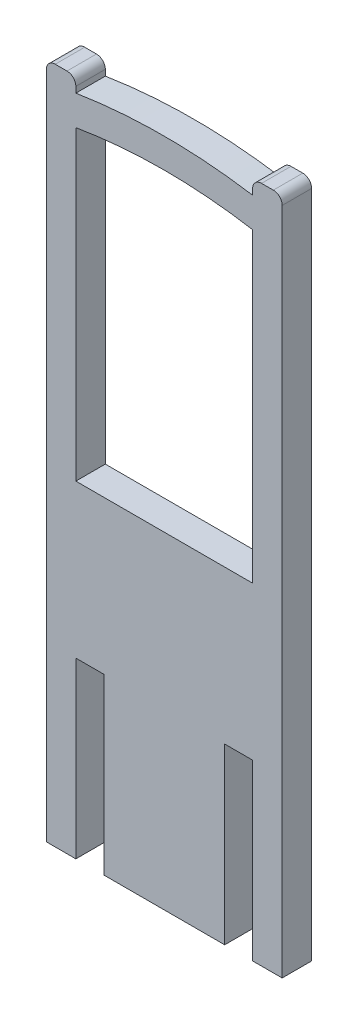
ISO-10303-21;
HEADER;
FILE_DESCRIPTION(('STEP AP214'),'2;1');
FILE_NAME('part.step','',(''),(''),'','','');
FILE_SCHEMA(('AUTOMOTIVE_DESIGN { 1 0 10303 214 1 1 1 1 }'));
ENDSEC;
DATA;
#1=APPLICATION_CONTEXT('core data for automotive mechanical design processes');
#2=APPLICATION_PROTOCOL_DEFINITION('international standard','automotive_design',2000,#1);
#3=PRODUCT_CONTEXT('',#1,'mechanical');
#4=PRODUCT('Part','Part','',(#3));
#5=PRODUCT_RELATED_PRODUCT_CATEGORY('part','',(#4));
#6=PRODUCT_DEFINITION_FORMATION('','',#4);
#7=PRODUCT_DEFINITION_CONTEXT('part definition',#1,'design');
#8=PRODUCT_DEFINITION('design','',#6,#7);
#9=PRODUCT_DEFINITION_SHAPE('','',#8);
#10=(LENGTH_UNIT() NAMED_UNIT(*) SI_UNIT(.MILLI.,.METRE.));
#11=(NAMED_UNIT(*) PLANE_ANGLE_UNIT() SI_UNIT($,.RADIAN.));
#12=(NAMED_UNIT(*) SI_UNIT($,.STERADIAN.) SOLID_ANGLE_UNIT());
#13=UNCERTAINTY_MEASURE_WITH_UNIT(LENGTH_MEASURE(1.E-05),#10,'distance_accuracy_value','');
#14=(GEOMETRIC_REPRESENTATION_CONTEXT(3) GLOBAL_UNCERTAINTY_ASSIGNED_CONTEXT((#13)) GLOBAL_UNIT_ASSIGNED_CONTEXT((#10,
#11,#12)) REPRESENTATION_CONTEXT('',''));
#15=CARTESIAN_POINT('',(0.,0.,0.));
#16=DIRECTION('',(0.,0.,1.));
#17=DIRECTION('',(1.,0.,0.));
#18=AXIS2_PLACEMENT_3D('',#15,#16,#17);
#19=CARTESIAN_POINT('',(37.0000000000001,236.,10.));
#20=DIRECTION('',(0.,0.,1.));
#21=DIRECTION('',(1.,0.,0.));
#22=AXIS2_PLACEMENT_3D('',#19,#20,#21);
#23=PLANE('',#22);
#24=DIRECTION('',(0.,1.,0.));
#25=VECTOR('',#24,1.);
#26=CARTESIAN_POINT('',(-30.,9.,10.));
#27=LINE('',#26,#25);
#28=CARTESIAN_POINT('',(-30.,9.,10.));
#29=VERTEX_POINT('',#28);
#30=CARTESIAN_POINT('',(-30.,68.,10.));
#31=VERTEX_POINT('',#30);
#32=EDGE_CURVE('E230',#29,#31,#27,.T.);
#33=ORIENTED_EDGE('',*,*,#32,.T.);
#34=DIRECTION('',(1.,0.,0.));
#35=VECTOR('',#34,1.);
#36=CARTESIAN_POINT('',(-30.,68.,10.));
#37=LINE('',#36,#35);
#38=CARTESIAN_POINT('',(-20.5000000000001,68.,10.));
#39=VERTEX_POINT('',#38);
#40=EDGE_CURVE('E233',#31,#39,#37,.T.);
#41=ORIENTED_EDGE('',*,*,#40,.T.);
#42=DIRECTION('',(0.,-1.,0.));
#43=VECTOR('',#42,1.);
#44=CARTESIAN_POINT('',(-20.5000000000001,68.,10.));
#45=LINE('',#44,#43);
#46=CARTESIAN_POINT('',(-20.5000000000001,8.99999999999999,10.));
#47=VERTEX_POINT('',#46);
#48=EDGE_CURVE('E236',#39,#47,#45,.T.);
#49=ORIENTED_EDGE('',*,*,#48,.T.);
#50=DIRECTION('',(1.,0.,0.));
#51=VECTOR('',#50,1.);
#52=CARTESIAN_POINT('',(20.5000000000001,8.99999999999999,10.));
#53=LINE('',#52,#51);
#54=CARTESIAN_POINT('',(20.5000000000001,8.99999999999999,10.));
#55=VERTEX_POINT('',#54);
#56=EDGE_CURVE('E238',#47,#55,#53,.T.);
#57=ORIENTED_EDGE('',*,*,#56,.T.);
#58=DIRECTION('',(0.,1.,0.));
#59=VECTOR('',#58,1.);
#60=CARTESIAN_POINT('',(20.5000000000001,68.,10.));
#61=LINE('',#60,#59);
#62=CARTESIAN_POINT('',(20.5000000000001,68.,10.));
#63=VERTEX_POINT('',#62);
#64=EDGE_CURVE('E240',#55,#63,#61,.T.);
#65=ORIENTED_EDGE('',*,*,#64,.T.);
#66=DIRECTION('',(1.,0.,0.));
#67=VECTOR('',#66,1.);
#68=CARTESIAN_POINT('',(30.,68.,10.));
#69=LINE('',#68,#67);
#70=CARTESIAN_POINT('',(30.,68.,10.));
#71=VERTEX_POINT('',#70);
#72=EDGE_CURVE('E242',#63,#71,#69,.T.);
#73=ORIENTED_EDGE('',*,*,#72,.T.);
#74=DIRECTION('',(0.,-1.,0.));
#75=VECTOR('',#74,1.);
#76=CARTESIAN_POINT('',(30.,9.00000000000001,10.));
#77=LINE('',#76,#75);
#78=CARTESIAN_POINT('',(30.,9.00000000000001,10.));
#79=VERTEX_POINT('',#78);
#80=EDGE_CURVE('E244',#71,#79,#77,.T.);
#81=ORIENTED_EDGE('',*,*,#80,.T.);
#82=DIRECTION('',(1.,0.,0.));
#83=VECTOR('',#82,1.);
#84=CARTESIAN_POINT('',(30.,9.00000000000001,10.));
#85=LINE('',#84,#83);
#86=CARTESIAN_POINT('',(40.,9.00000000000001,10.));
#87=VERTEX_POINT('',#86);
#88=EDGE_CURVE('E246',#79,#87,#85,.T.);
#89=ORIENTED_EDGE('',*,*,#88,.T.);
#90=DIRECTION('',(0.,1.,0.));
#91=VECTOR('',#90,1.);
#92=CARTESIAN_POINT('',(40.,9.00000000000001,10.));
#93=LINE('',#92,#91);
#94=CARTESIAN_POINT('',(40.,236.,10.));
#95=VERTEX_POINT('',#94);
#96=EDGE_CURVE('E248',#87,#95,#93,.T.);
#97=ORIENTED_EDGE('',*,*,#96,.T.);
#98=CARTESIAN_POINT('',(37.0000000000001,236.,10.));
#99=DIRECTION('',(0.,0.,1.));
#100=DIRECTION('',(1.,0.,0.));
#101=AXIS2_PLACEMENT_3D('',#98,#99,#100);
#102=CIRCLE('',#101,2.99999999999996);
#103=CARTESIAN_POINT('',(37.0000000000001,239.,10.));
#104=VERTEX_POINT('',#103);
#105=EDGE_CURVE('E250',#95,#104,#102,.T.);
#106=ORIENTED_EDGE('',*,*,#105,.T.);
#107=DIRECTION('',(-1.,0.,0.));
#108=VECTOR('',#107,1.);
#109=CARTESIAN_POINT('',(33.,239.,10.));
#110=LINE('',#109,#108);
#111=CARTESIAN_POINT('',(33.,239.,10.));
#112=VERTEX_POINT('',#111);
#113=EDGE_CURVE('E252',#104,#112,#110,.T.);
#114=ORIENTED_EDGE('',*,*,#113,.T.);
#115=CARTESIAN_POINT('',(33.,236.,10.));
#116=DIRECTION('',(0.,0.,1.));
#117=DIRECTION('',(1.,0.,0.));
#118=AXIS2_PLACEMENT_3D('',#115,#116,#117);
#119=CIRCLE('',#118,3.00000000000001);
#120=CARTESIAN_POINT('',(30.,236.,10.));
#121=VERTEX_POINT('',#120);
#122=EDGE_CURVE('E254',#112,#121,#119,.T.);
#123=ORIENTED_EDGE('',*,*,#122,.T.);
#124=DIRECTION('',(0.,-1.,0.));
#125=VECTOR('',#124,1.);
#126=CARTESIAN_POINT('',(30.,236.,10.));
#127=LINE('',#126,#125);
#128=CARTESIAN_POINT('',(30.,234.,10.));
#129=VERTEX_POINT('',#128);
#130=EDGE_CURVE('E256',#121,#129,#127,.T.);
#131=ORIENTED_EDGE('',*,*,#130,.T.);
#132=CARTESIAN_POINT('',(0.,46.3833696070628,10.));
#133=DIRECTION('',(0.,0.,1.));
#134=DIRECTION('',(1.,0.,0.));
#135=AXIS2_PLACEMENT_3D('',#132,#133,#134);
#136=CIRCLE('',#135,190.);
#137=CARTESIAN_POINT('',(-30.,234.,10.));
#138=VERTEX_POINT('',#137);
#139=EDGE_CURVE('E258',#129,#138,#136,.T.);
#140=ORIENTED_EDGE('',*,*,#139,.T.);
#141=DIRECTION('',(0.,1.,0.));
#142=VECTOR('',#141,1.);
#143=CARTESIAN_POINT('',(-30.,236.,10.));
#144=LINE('',#143,#142);
#145=CARTESIAN_POINT('',(-30.,236.,10.));
#146=VERTEX_POINT('',#145);
#147=EDGE_CURVE('E260',#138,#146,#144,.T.);
#148=ORIENTED_EDGE('',*,*,#147,.T.);
#149=CARTESIAN_POINT('',(-33.,236.,10.));
#150=DIRECTION('',(0.,0.,1.));
#151=DIRECTION('',(1.,0.,0.));
#152=AXIS2_PLACEMENT_3D('',#149,#150,#151);
#153=CIRCLE('',#152,3.00000000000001);
#154=CARTESIAN_POINT('',(-33.,239.,10.));
#155=VERTEX_POINT('',#154);
#156=EDGE_CURVE('E262',#146,#155,#153,.T.);
#157=ORIENTED_EDGE('',*,*,#156,.T.);
#158=DIRECTION('',(-1.,0.,0.));
#159=VECTOR('',#158,1.);
#160=CARTESIAN_POINT('',(-33.,239.,10.));
#161=LINE('',#160,#159);
#162=CARTESIAN_POINT('',(-37.0000000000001,239.,10.));
#163=VERTEX_POINT('',#162);
#164=EDGE_CURVE('E264',#155,#163,#161,.T.);
#165=ORIENTED_EDGE('',*,*,#164,.T.);
#166=CARTESIAN_POINT('',(-37.0000000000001,236.,10.));
#167=DIRECTION('',(0.,0.,1.));
#168=DIRECTION('',(-1.,0.,0.));
#169=AXIS2_PLACEMENT_3D('',#166,#167,#168);
#170=CIRCLE('',#169,2.99999999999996);
#171=CARTESIAN_POINT('',(-40.,236.,10.));
#172=VERTEX_POINT('',#171);
#173=EDGE_CURVE('E266',#163,#172,#170,.T.);
#174=ORIENTED_EDGE('',*,*,#173,.T.);
#175=DIRECTION('',(0.,-1.,0.));
#176=VECTOR('',#175,1.);
#177=CARTESIAN_POINT('',(-40.,9.,10.));
#178=LINE('',#177,#176);
#179=CARTESIAN_POINT('',(-40.,9.,10.));
#180=VERTEX_POINT('',#179);
#181=EDGE_CURVE('E268',#172,#180,#178,.T.);
#182=ORIENTED_EDGE('',*,*,#181,.T.);
#183=DIRECTION('',(1.,0.,0.));
#184=VECTOR('',#183,1.);
#185=CARTESIAN_POINT('',(-30.,9.,10.));
#186=LINE('',#185,#184);
#187=EDGE_CURVE('E270',#180,#29,#186,.T.);
#188=ORIENTED_EDGE('',*,*,#187,.T.);
#189=EDGE_LOOP('',(#33,#41,#49,#57,#65,#73,#81,#89,#97,#106,#114,#123,#131,#140,#148,#157,#165,
#174,#182,#188));
#190=FACE_BOUND('',#189,.T.);
#191=DIRECTION('',(1.,0.,0.));
#192=VECTOR('',#191,1.);
#193=CARTESIAN_POINT('',(-30.,120.,10.));
#194=LINE('',#193,#192);
#195=CARTESIAN_POINT('',(-30.,120.,10.));
#196=VERTEX_POINT('',#195);
#197=CARTESIAN_POINT('',(30.,120.,10.));
#198=VERTEX_POINT('',#197);
#199=EDGE_CURVE('E202',#196,#198,#194,.T.);
#200=ORIENTED_EDGE('',*,*,#199,.F.);
#201=DIRECTION('',(0.,-1.,0.));
#202=VECTOR('',#201,1.);
#203=CARTESIAN_POINT('',(-30.,223.865763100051,10.));
#204=LINE('',#203,#202);
#205=CARTESIAN_POINT('',(-30.,223.865763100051,10.));
#206=VERTEX_POINT('',#205);
#207=EDGE_CURVE('E194',#206,#196,#204,.T.);
#208=ORIENTED_EDGE('',*,*,#207,.F.);
#209=CARTESIAN_POINT('',(0.,46.3833696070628,10.));
#210=DIRECTION('',(0.,0.,1.));
#211=DIRECTION('',(1.,0.,0.));
#212=AXIS2_PLACEMENT_3D('',#209,#210,#211);
#213=CIRCLE('',#212,180.);
#214=CARTESIAN_POINT('',(30.,223.865763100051,10.));
#215=VERTEX_POINT('',#214);
#216=EDGE_CURVE('E216',#215,#206,#213,.T.);
#217=ORIENTED_EDGE('',*,*,#216,.F.);
#218=DIRECTION('',(0.,1.,0.));
#219=VECTOR('',#218,1.);
#220=CARTESIAN_POINT('',(30.,223.865763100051,10.));
#221=LINE('',#220,#219);
#222=EDGE_CURVE('E214',#198,#215,#221,.T.);
#223=ORIENTED_EDGE('',*,*,#222,.F.);
#224=EDGE_LOOP('',(#200,#208,#217,#223));
#225=FACE_BOUND('',#224,.T.);
#226=ADVANCED_FACE('F33',(#190,#225),#23,.T.);
#227=CARTESIAN_POINT('',(37.0000000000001,236.,0.));
#228=DIRECTION('',(0.,0.,1.));
#229=DIRECTION('',(1.,0.,0.));
#230=AXIS2_PLACEMENT_3D('',#227,#228,#229);
#231=PLANE('',#230);
#232=DIRECTION('',(0.,1.,0.));
#233=VECTOR('',#232,1.);
#234=CARTESIAN_POINT('',(-30.,9.,0.));
#235=LINE('',#234,#233);
#236=CARTESIAN_POINT('',(-30.,9.,0.));
#237=VERTEX_POINT('',#236);
#238=CARTESIAN_POINT('',(-30.,68.,0.));
#239=VERTEX_POINT('',#238);
#240=EDGE_CURVE('E210',#237,#239,#235,.T.);
#241=ORIENTED_EDGE('',*,*,#240,.F.);
#242=DIRECTION('',(1.,0.,0.));
#243=VECTOR('',#242,1.);
#244=CARTESIAN_POINT('',(-30.,9.,0.));
#245=LINE('',#244,#243);
#246=CARTESIAN_POINT('',(-40.,9.,0.));
#247=VERTEX_POINT('',#246);
#248=EDGE_CURVE('E234',#247,#237,#245,.T.);
#249=ORIENTED_EDGE('',*,*,#248,.F.);
#250=DIRECTION('',(0.,-1.,0.));
#251=VECTOR('',#250,1.);
#252=CARTESIAN_POINT('',(-40.,9.,0.));
#253=LINE('',#252,#251);
#254=CARTESIAN_POINT('',(-40.,236.,0.));
#255=VERTEX_POINT('',#254);
#256=EDGE_CURVE('E309',#255,#247,#253,.T.);
#257=ORIENTED_EDGE('',*,*,#256,.F.);
#258=CARTESIAN_POINT('',(-37.0000000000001,236.,0.));
#259=DIRECTION('',(0.,0.,1.));
#260=DIRECTION('',(-1.,0.,0.));
#261=AXIS2_PLACEMENT_3D('',#258,#259,#260);
#262=CIRCLE('',#261,2.99999999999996);
#263=CARTESIAN_POINT('',(-37.0000000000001,239.,0.));
#264=VERTEX_POINT('',#263);
#265=EDGE_CURVE('E307',#264,#255,#262,.T.);
#266=ORIENTED_EDGE('',*,*,#265,.F.);
#267=DIRECTION('',(-1.,0.,0.));
#268=VECTOR('',#267,1.);
#269=CARTESIAN_POINT('',(-33.,239.,0.));
#270=LINE('',#269,#268);
#271=CARTESIAN_POINT('',(-33.,239.,0.));
#272=VERTEX_POINT('',#271);
#273=EDGE_CURVE('E305',#272,#264,#270,.T.);
#274=ORIENTED_EDGE('',*,*,#273,.F.);
#275=CARTESIAN_POINT('',(-33.,236.,0.));
#276=DIRECTION('',(0.,0.,1.));
#277=DIRECTION('',(1.,0.,0.));
#278=AXIS2_PLACEMENT_3D('',#275,#276,#277);
#279=CIRCLE('',#278,3.00000000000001);
#280=CARTESIAN_POINT('',(-30.,236.,0.));
#281=VERTEX_POINT('',#280);
#282=EDGE_CURVE('E303',#281,#272,#279,.T.);
#283=ORIENTED_EDGE('',*,*,#282,.F.);
#284=DIRECTION('',(0.,1.,0.));
#285=VECTOR('',#284,1.);
#286=CARTESIAN_POINT('',(-30.,236.,0.));
#287=LINE('',#286,#285);
#288=CARTESIAN_POINT('',(-30.,234.,0.));
#289=VERTEX_POINT('',#288);
#290=EDGE_CURVE('E301',#289,#281,#287,.T.);
#291=ORIENTED_EDGE('',*,*,#290,.F.);
#292=CARTESIAN_POINT('',(0.,46.3833696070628,0.));
#293=DIRECTION('',(0.,0.,1.));
#294=DIRECTION('',(1.,0.,0.));
#295=AXIS2_PLACEMENT_3D('',#292,#293,#294);
#296=CIRCLE('',#295,190.);
#297=CARTESIAN_POINT('',(30.,234.,0.));
#298=VERTEX_POINT('',#297);
#299=EDGE_CURVE('E299',#298,#289,#296,.T.);
#300=ORIENTED_EDGE('',*,*,#299,.F.);
#301=DIRECTION('',(0.,-1.,0.));
#302=VECTOR('',#301,1.);
#303=CARTESIAN_POINT('',(30.,236.,0.));
#304=LINE('',#303,#302);
#305=CARTESIAN_POINT('',(30.,236.,0.));
#306=VERTEX_POINT('',#305);
#307=EDGE_CURVE('E297',#306,#298,#304,.T.);
#308=ORIENTED_EDGE('',*,*,#307,.F.);
#309=CARTESIAN_POINT('',(33.,236.,0.));
#310=DIRECTION('',(0.,0.,1.));
#311=DIRECTION('',(1.,0.,0.));
#312=AXIS2_PLACEMENT_3D('',#309,#310,#311);
#313=CIRCLE('',#312,3.00000000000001);
#314=CARTESIAN_POINT('',(33.,239.,0.));
#315=VERTEX_POINT('',#314);
#316=EDGE_CURVE('E295',#315,#306,#313,.T.);
#317=ORIENTED_EDGE('',*,*,#316,.F.);
#318=DIRECTION('',(-1.,0.,0.));
#319=VECTOR('',#318,1.);
#320=CARTESIAN_POINT('',(33.,239.,0.));
#321=LINE('',#320,#319);
#322=CARTESIAN_POINT('',(37.0000000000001,239.,0.));
#323=VERTEX_POINT('',#322);
#324=EDGE_CURVE('E293',#323,#315,#321,.T.);
#325=ORIENTED_EDGE('',*,*,#324,.F.);
#326=CARTESIAN_POINT('',(37.0000000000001,236.,0.));
#327=DIRECTION('',(0.,0.,1.));
#328=DIRECTION('',(1.,0.,0.));
#329=AXIS2_PLACEMENT_3D('',#326,#327,#328);
#330=CIRCLE('',#329,2.99999999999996);
#331=CARTESIAN_POINT('',(40.,236.,0.));
#332=VERTEX_POINT('',#331);
#333=EDGE_CURVE('E291',#332,#323,#330,.T.);
#334=ORIENTED_EDGE('',*,*,#333,.F.);
#335=DIRECTION('',(0.,1.,0.));
#336=VECTOR('',#335,1.);
#337=CARTESIAN_POINT('',(40.,9.00000000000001,0.));
#338=LINE('',#337,#336);
#339=CARTESIAN_POINT('',(40.,9.00000000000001,0.));
#340=VERTEX_POINT('',#339);
#341=EDGE_CURVE('E289',#340,#332,#338,.T.);
#342=ORIENTED_EDGE('',*,*,#341,.F.);
#343=DIRECTION('',(1.,0.,0.));
#344=VECTOR('',#343,1.);
#345=CARTESIAN_POINT('',(30.,9.00000000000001,0.));
#346=LINE('',#345,#344);
#347=CARTESIAN_POINT('',(30.,9.00000000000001,0.));
#348=VERTEX_POINT('',#347);
#349=EDGE_CURVE('E287',#348,#340,#346,.T.);
#350=ORIENTED_EDGE('',*,*,#349,.F.);
#351=DIRECTION('',(0.,-1.,0.));
#352=VECTOR('',#351,1.);
#353=CARTESIAN_POINT('',(30.,9.00000000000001,0.));
#354=LINE('',#353,#352);
#355=CARTESIAN_POINT('',(30.,68.,0.));
#356=VERTEX_POINT('',#355);
#357=EDGE_CURVE('E285',#356,#348,#354,.T.);
#358=ORIENTED_EDGE('',*,*,#357,.F.);
#359=DIRECTION('',(1.,0.,0.));
#360=VECTOR('',#359,1.);
#361=CARTESIAN_POINT('',(30.,68.,0.));
#362=LINE('',#361,#360);
#363=CARTESIAN_POINT('',(20.5000000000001,68.,0.));
#364=VERTEX_POINT('',#363);
#365=EDGE_CURVE('E283',#364,#356,#362,.T.);
#366=ORIENTED_EDGE('',*,*,#365,.F.);
#367=DIRECTION('',(0.,1.,0.));
#368=VECTOR('',#367,1.);
#369=CARTESIAN_POINT('',(20.5000000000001,68.,0.));
#370=LINE('',#369,#368);
#371=CARTESIAN_POINT('',(20.5000000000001,8.99999999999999,0.));
#372=VERTEX_POINT('',#371);
#373=EDGE_CURVE('E281',#372,#364,#370,.T.);
#374=ORIENTED_EDGE('',*,*,#373,.F.);
#375=DIRECTION('',(1.,0.,0.));
#376=VECTOR('',#375,1.);
#377=CARTESIAN_POINT('',(20.5000000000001,8.99999999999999,0.));
#378=LINE('',#377,#376);
#379=CARTESIAN_POINT('',(-20.5000000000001,8.99999999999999,0.));
#380=VERTEX_POINT('',#379);
#381=EDGE_CURVE('E279',#380,#372,#378,.T.);
#382=ORIENTED_EDGE('',*,*,#381,.F.);
#383=DIRECTION('',(0.,-1.,0.));
#384=VECTOR('',#383,1.);
#385=CARTESIAN_POINT('',(-20.5000000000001,68.,0.));
#386=LINE('',#385,#384);
#387=CARTESIAN_POINT('',(-20.5000000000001,68.,0.));
#388=VERTEX_POINT('',#387);
#389=EDGE_CURVE('E277',#388,#380,#386,.T.);
#390=ORIENTED_EDGE('',*,*,#389,.F.);
#391=DIRECTION('',(1.,0.,0.));
#392=VECTOR('',#391,1.);
#393=CARTESIAN_POINT('',(-30.,68.,0.));
#394=LINE('',#393,#392);
#395=EDGE_CURVE('E275',#239,#388,#394,.T.);
#396=ORIENTED_EDGE('',*,*,#395,.F.);
#397=EDGE_LOOP('',(#241,#249,#257,#266,#274,#283,#291,#300,#308,#317,#325,#334,#342,#350,#358,
#366,#374,#382,#390,#396));
#398=FACE_BOUND('',#397,.T.);
#399=DIRECTION('',(0.,-1.,0.));
#400=VECTOR('',#399,1.);
#401=CARTESIAN_POINT('',(-30.,223.865763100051,0.));
#402=LINE('',#401,#400);
#403=CARTESIAN_POINT('',(-30.,223.865763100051,0.));
#404=VERTEX_POINT('',#403);
#405=CARTESIAN_POINT('',(-30.,120.,0.));
#406=VERTEX_POINT('',#405);
#407=EDGE_CURVE('E56',#404,#406,#402,.T.);
#408=ORIENTED_EDGE('',*,*,#407,.T.);
#409=DIRECTION('',(1.,0.,0.));
#410=VECTOR('',#409,1.);
#411=CARTESIAN_POINT('',(-30.,120.,0.));
#412=LINE('',#411,#410);
#413=CARTESIAN_POINT('',(30.,120.,0.));
#414=VERTEX_POINT('',#413);
#415=EDGE_CURVE('E209',#406,#414,#412,.T.);
#416=ORIENTED_EDGE('',*,*,#415,.T.);
#417=DIRECTION('',(0.,1.,0.));
#418=VECTOR('',#417,1.);
#419=CARTESIAN_POINT('',(30.,223.865763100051,0.));
#420=LINE('',#419,#418);
#421=CARTESIAN_POINT('',(30.,223.865763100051,0.));
#422=VERTEX_POINT('',#421);
#423=EDGE_CURVE('E222',#414,#422,#420,.T.);
#424=ORIENTED_EDGE('',*,*,#423,.T.);
#425=CARTESIAN_POINT('',(0.,46.3833696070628,0.));
#426=DIRECTION('',(0.,0.,1.));
#427=DIRECTION('',(1.,0.,0.));
#428=AXIS2_PLACEMENT_3D('',#425,#426,#427);
#429=CIRCLE('',#428,180.);
#430=EDGE_CURVE('E203',#422,#404,#429,.T.);
#431=ORIENTED_EDGE('',*,*,#430,.T.);
#432=EDGE_LOOP('',(#408,#416,#424,#431));
#433=FACE_BOUND('',#432,.T.);
#434=ADVANCED_FACE('F375',(#398,#433),#231,.F.);
#435=CARTESIAN_POINT('',(-30.,9.,10.));
#436=DIRECTION('',(-1.,0.,0.));
#437=DIRECTION('',(0.,0.,1.));
#438=AXIS2_PLACEMENT_3D('',#435,#436,#437);
#439=PLANE('',#438);
#440=ORIENTED_EDGE('',*,*,#240,.T.);
#441=DIRECTION('',(0.,0.,-1.));
#442=VECTOR('',#441,1.);
#443=CARTESIAN_POINT('',(-30.,68.,10.));
#444=LINE('',#443,#442);
#445=EDGE_CURVE('E11',#31,#239,#444,.T.);
#446=ORIENTED_EDGE('',*,*,#445,.F.);
#447=ORIENTED_EDGE('',*,*,#32,.F.);
#448=DIRECTION('',(0.,0.,-1.));
#449=VECTOR('',#448,1.);
#450=CARTESIAN_POINT('',(-30.,9.,10.));
#451=LINE('',#450,#449);
#452=EDGE_CURVE('E272',#29,#237,#451,.T.);
#453=ORIENTED_EDGE('',*,*,#452,.T.);
#454=EDGE_LOOP('',(#440,#446,#447,#453));
#455=FACE_BOUND('',#454,.T.);
#456=ADVANCED_FACE('F35',(#455),#439,.F.);
#457=CARTESIAN_POINT('',(-30.,68.,10.));
#458=DIRECTION('',(0.,1.,0.));
#459=DIRECTION('',(0.,0.,1.));
#460=AXIS2_PLACEMENT_3D('',#457,#458,#459);
#461=PLANE('',#460);
#462=ORIENTED_EDGE('',*,*,#395,.T.);
#463=DIRECTION('',(0.,0.,-1.));
#464=VECTOR('',#463,1.);
#465=CARTESIAN_POINT('',(-20.5000000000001,68.,10.));
#466=LINE('',#465,#464);
#467=EDGE_CURVE('E41',#39,#388,#466,.T.);
#468=ORIENTED_EDGE('',*,*,#467,.F.);
#469=ORIENTED_EDGE('',*,*,#40,.F.);
#470=ORIENTED_EDGE('',*,*,#445,.T.);
#471=EDGE_LOOP('',(#462,#468,#469,#470));
#472=FACE_BOUND('',#471,.T.);
#473=ADVANCED_FACE('F392',(#472),#461,.F.);
#474=CARTESIAN_POINT('',(-20.5000000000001,68.,10.));
#475=DIRECTION('',(1.,0.,0.));
#476=DIRECTION('',(0.,1.,0.));
#477=AXIS2_PLACEMENT_3D('',#474,#475,#476);
#478=PLANE('',#477);
#479=ORIENTED_EDGE('',*,*,#389,.T.);
#480=DIRECTION('',(0.,0.,-1.));
#481=VECTOR('',#480,1.);
#482=CARTESIAN_POINT('',(-20.5000000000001,8.99999999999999,10.));
#483=LINE('',#482,#481);
#484=EDGE_CURVE('E362',#47,#380,#483,.T.);
#485=ORIENTED_EDGE('',*,*,#484,.F.);
#486=ORIENTED_EDGE('',*,*,#48,.F.);
#487=ORIENTED_EDGE('',*,*,#467,.T.);
#488=EDGE_LOOP('',(#479,#485,#486,#487));
#489=FACE_BOUND('',#488,.T.);
#490=ADVANCED_FACE('F369',(#489),#478,.F.);
#491=CARTESIAN_POINT('',(20.5000000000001,8.99999999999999,10.));
#492=DIRECTION('',(0.,1.,0.));
#493=DIRECTION('',(0.,0.,1.));
#494=AXIS2_PLACEMENT_3D('',#491,#492,#493);
#495=PLANE('',#494);
#496=ORIENTED_EDGE('',*,*,#381,.T.);
#497=DIRECTION('',(0.,0.,-1.));
#498=VECTOR('',#497,1.);
#499=CARTESIAN_POINT('',(20.5000000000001,8.99999999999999,10.));
#500=LINE('',#499,#498);
#501=EDGE_CURVE('E359',#55,#372,#500,.T.);
#502=ORIENTED_EDGE('',*,*,#501,.F.);
#503=ORIENTED_EDGE('',*,*,#56,.F.);
#504=ORIENTED_EDGE('',*,*,#484,.T.);
#505=EDGE_LOOP('',(#496,#502,#503,#504));
#506=FACE_BOUND('',#505,.T.);
#507=ADVANCED_FACE('F381',(#506),#495,.F.);
#508=CARTESIAN_POINT('',(20.5000000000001,68.,10.));
#509=DIRECTION('',(-1.,0.,0.));
#510=DIRECTION('',(0.,-1.,0.));
#511=AXIS2_PLACEMENT_3D('',#508,#509,#510);
#512=PLANE('',#511);
#513=ORIENTED_EDGE('',*,*,#373,.T.);
#514=DIRECTION('',(0.,0.,-1.));
#515=VECTOR('',#514,1.);
#516=CARTESIAN_POINT('',(20.5000000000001,68.,10.));
#517=LINE('',#516,#515);
#518=EDGE_CURVE('E356',#63,#364,#517,.T.);
#519=ORIENTED_EDGE('',*,*,#518,.F.);
#520=ORIENTED_EDGE('',*,*,#64,.F.);
#521=ORIENTED_EDGE('',*,*,#501,.T.);
#522=EDGE_LOOP('',(#513,#519,#520,#521));
#523=FACE_BOUND('',#522,.T.);
#524=ADVANCED_FACE('F385',(#523),#512,.F.);
#525=CARTESIAN_POINT('',(30.,68.,10.));
#526=DIRECTION('',(0.,1.,0.));
#527=DIRECTION('',(0.,0.,1.));
#528=AXIS2_PLACEMENT_3D('',#525,#526,#527);
#529=PLANE('',#528);
#530=ORIENTED_EDGE('',*,*,#365,.T.);
#531=DIRECTION('',(0.,0.,-1.));
#532=VECTOR('',#531,1.);
#533=CARTESIAN_POINT('',(30.,68.,10.));
#534=LINE('',#533,#532);
#535=EDGE_CURVE('E353',#71,#356,#534,.T.);
#536=ORIENTED_EDGE('',*,*,#535,.F.);
#537=ORIENTED_EDGE('',*,*,#72,.F.);
#538=ORIENTED_EDGE('',*,*,#518,.T.);
#539=EDGE_LOOP('',(#530,#536,#537,#538));
#540=FACE_BOUND('',#539,.T.);
#541=ADVANCED_FACE('F465',(#540),#529,.F.);
#542=CARTESIAN_POINT('',(30.,9.00000000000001,10.));
#543=DIRECTION('',(1.,0.,0.));
#544=DIRECTION('',(0.,0.,-1.));
#545=AXIS2_PLACEMENT_3D('',#542,#543,#544);
#546=PLANE('',#545);
#547=ORIENTED_EDGE('',*,*,#357,.T.);
#548=DIRECTION('',(0.,0.,-1.));
#549=VECTOR('',#548,1.);
#550=CARTESIAN_POINT('',(30.,9.00000000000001,10.));
#551=LINE('',#550,#549);
#552=EDGE_CURVE('E350',#79,#348,#551,.T.);
#553=ORIENTED_EDGE('',*,*,#552,.F.);
#554=ORIENTED_EDGE('',*,*,#80,.F.);
#555=ORIENTED_EDGE('',*,*,#535,.T.);
#556=EDGE_LOOP('',(#547,#553,#554,#555));
#557=FACE_BOUND('',#556,.T.);
#558=ADVANCED_FACE('F463',(#557),#546,.F.);
#559=CARTESIAN_POINT('',(30.,9.00000000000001,10.));
#560=DIRECTION('',(0.,1.,0.));
#561=DIRECTION('',(0.,0.,1.));
#562=AXIS2_PLACEMENT_3D('',#559,#560,#561);
#563=PLANE('',#562);
#564=ORIENTED_EDGE('',*,*,#349,.T.);
#565=DIRECTION('',(0.,0.,-1.));
#566=VECTOR('',#565,1.);
#567=CARTESIAN_POINT('',(40.,9.00000000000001,10.));
#568=LINE('',#567,#566);
#569=EDGE_CURVE('E347',#87,#340,#568,.T.);
#570=ORIENTED_EDGE('',*,*,#569,.F.);
#571=ORIENTED_EDGE('',*,*,#88,.F.);
#572=ORIENTED_EDGE('',*,*,#552,.T.);
#573=EDGE_LOOP('',(#564,#570,#571,#572));
#574=FACE_BOUND('',#573,.T.);
#575=ADVANCED_FACE('F458',(#574),#563,.F.);
#576=CARTESIAN_POINT('',(40.,9.00000000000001,10.));
#577=DIRECTION('',(-1.,0.,0.));
#578=DIRECTION('',(0.,-1.,0.));
#579=AXIS2_PLACEMENT_3D('',#576,#577,#578);
#580=PLANE('',#579);
#581=ORIENTED_EDGE('',*,*,#341,.T.);
#582=DIRECTION('',(0.,0.,-1.));
#583=VECTOR('',#582,1.);
#584=CARTESIAN_POINT('',(40.,236.,10.));
#585=LINE('',#584,#583);
#586=EDGE_CURVE('E344',#95,#332,#585,.T.);
#587=ORIENTED_EDGE('',*,*,#586,.F.);
#588=ORIENTED_EDGE('',*,*,#96,.F.);
#589=ORIENTED_EDGE('',*,*,#569,.T.);
#590=EDGE_LOOP('',(#581,#587,#588,#589));
#591=FACE_BOUND('',#590,.T.);
#592=ADVANCED_FACE('F453',(#591),#580,.F.);
#593=CARTESIAN_POINT('',(37.0000000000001,236.,10.));
#594=DIRECTION('',(0.,0.,-1.));
#595=DIRECTION('',(-1.,0.,0.));
#596=AXIS2_PLACEMENT_3D('',#593,#594,#595);
#597=CYLINDRICAL_SURFACE('',#596,2.99999999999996);
#598=ORIENTED_EDGE('',*,*,#333,.T.);
#599=DIRECTION('',(0.,0.,-1.));
#600=VECTOR('',#599,1.);
#601=CARTESIAN_POINT('',(37.0000000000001,239.,10.));
#602=LINE('',#601,#600);
#603=EDGE_CURVE('E341',#104,#323,#602,.T.);
#604=ORIENTED_EDGE('',*,*,#603,.F.);
#605=ORIENTED_EDGE('',*,*,#105,.F.);
#606=ORIENTED_EDGE('',*,*,#586,.T.);
#607=EDGE_LOOP('',(#598,#604,#605,#606));
#608=FACE_BOUND('',#607,.T.);
#609=ADVANCED_FACE('F449',(#608),#597,.T.);
#610=CARTESIAN_POINT('',(33.,239.,10.));
#611=DIRECTION('',(0.,-1.,0.));
#612=DIRECTION('',(1.,0.,0.));
#613=AXIS2_PLACEMENT_3D('',#610,#611,#612);
#614=PLANE('',#613);
#615=ORIENTED_EDGE('',*,*,#324,.T.);
#616=DIRECTION('',(0.,0.,-1.));
#617=VECTOR('',#616,1.);
#618=CARTESIAN_POINT('',(33.,239.,10.));
#619=LINE('',#618,#617);
#620=EDGE_CURVE('E338',#112,#315,#619,.T.);
#621=ORIENTED_EDGE('',*,*,#620,.F.);
#622=ORIENTED_EDGE('',*,*,#113,.F.);
#623=ORIENTED_EDGE('',*,*,#603,.T.);
#624=EDGE_LOOP('',(#615,#621,#622,#623));
#625=FACE_BOUND('',#624,.T.);
#626=ADVANCED_FACE('F444',(#625),#614,.F.);
#627=CARTESIAN_POINT('',(33.,236.,10.));
#628=DIRECTION('',(0.,0.,-1.));
#629=DIRECTION('',(-1.,0.,0.));
#630=AXIS2_PLACEMENT_3D('',#627,#628,#629);
#631=CYLINDRICAL_SURFACE('',#630,3.00000000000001);
#632=ORIENTED_EDGE('',*,*,#316,.T.);
#633=DIRECTION('',(0.,0.,-1.));
#634=VECTOR('',#633,1.);
#635=CARTESIAN_POINT('',(30.,236.,10.));
#636=LINE('',#635,#634);
#637=EDGE_CURVE('E335',#121,#306,#636,.T.);
#638=ORIENTED_EDGE('',*,*,#637,.F.);
#639=ORIENTED_EDGE('',*,*,#122,.F.);
#640=ORIENTED_EDGE('',*,*,#620,.T.);
#641=EDGE_LOOP('',(#632,#638,#639,#640));
#642=FACE_BOUND('',#641,.T.);
#643=ADVANCED_FACE('F438',(#642),#631,.T.);
#644=CARTESIAN_POINT('',(30.,236.,10.));
#645=DIRECTION('',(1.,0.,0.));
#646=DIRECTION('',(0.,1.,0.));
#647=AXIS2_PLACEMENT_3D('',#644,#645,#646);
#648=PLANE('',#647);
#649=ORIENTED_EDGE('',*,*,#307,.T.);
#650=DIRECTION('',(0.,0.,-1.));
#651=VECTOR('',#650,1.);
#652=CARTESIAN_POINT('',(30.,234.,10.));
#653=LINE('',#652,#651);
#654=EDGE_CURVE('E332',#129,#298,#653,.T.);
#655=ORIENTED_EDGE('',*,*,#654,.F.);
#656=ORIENTED_EDGE('',*,*,#130,.F.);
#657=ORIENTED_EDGE('',*,*,#637,.T.);
#658=EDGE_LOOP('',(#649,#655,#656,#657));
#659=FACE_BOUND('',#658,.T.);
#660=ADVANCED_FACE('F434',(#659),#648,.F.);
#661=CARTESIAN_POINT('',(0.,46.3833696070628,10.));
#662=DIRECTION('',(0.,0.,-1.));
#663=DIRECTION('',(-1.,0.,0.));
#664=AXIS2_PLACEMENT_3D('',#661,#662,#663);
#665=CYLINDRICAL_SURFACE('',#664,190.);
#666=ORIENTED_EDGE('',*,*,#299,.T.);
#667=DIRECTION('',(0.,0.,-1.));
#668=VECTOR('',#667,1.);
#669=CARTESIAN_POINT('',(-30.,234.,10.));
#670=LINE('',#669,#668);
#671=EDGE_CURVE('E329',#138,#289,#670,.T.);
#672=ORIENTED_EDGE('',*,*,#671,.F.);
#673=ORIENTED_EDGE('',*,*,#139,.F.);
#674=ORIENTED_EDGE('',*,*,#654,.T.);
#675=EDGE_LOOP('',(#666,#672,#673,#674));
#676=FACE_BOUND('',#675,.T.);
#677=ADVANCED_FACE('F429',(#676),#665,.T.);
#678=CARTESIAN_POINT('',(-30.,236.,10.));
#679=DIRECTION('',(-1.,0.,0.));
#680=DIRECTION('',(0.,-1.,0.));
#681=AXIS2_PLACEMENT_3D('',#678,#679,#680);
#682=PLANE('',#681);
#683=ORIENTED_EDGE('',*,*,#290,.T.);
#684=DIRECTION('',(0.,0.,-1.));
#685=VECTOR('',#684,1.);
#686=CARTESIAN_POINT('',(-30.,236.,10.));
#687=LINE('',#686,#685);
#688=EDGE_CURVE('E326',#146,#281,#687,.T.);
#689=ORIENTED_EDGE('',*,*,#688,.F.);
#690=ORIENTED_EDGE('',*,*,#147,.F.);
#691=ORIENTED_EDGE('',*,*,#671,.T.);
#692=EDGE_LOOP('',(#683,#689,#690,#691));
#693=FACE_BOUND('',#692,.T.);
#694=ADVANCED_FACE('F423',(#693),#682,.F.);
#695=CARTESIAN_POINT('',(-33.,236.,10.));
#696=DIRECTION('',(0.,0.,-1.));
#697=DIRECTION('',(-1.,0.,0.));
#698=AXIS2_PLACEMENT_3D('',#695,#696,#697);
#699=CYLINDRICAL_SURFACE('',#698,3.00000000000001);
#700=ORIENTED_EDGE('',*,*,#282,.T.);
#701=DIRECTION('',(0.,0.,-1.));
#702=VECTOR('',#701,1.);
#703=CARTESIAN_POINT('',(-33.,239.,10.));
#704=LINE('',#703,#702);
#705=EDGE_CURVE('E323',#155,#272,#704,.T.);
#706=ORIENTED_EDGE('',*,*,#705,.F.);
#707=ORIENTED_EDGE('',*,*,#156,.F.);
#708=ORIENTED_EDGE('',*,*,#688,.T.);
#709=EDGE_LOOP('',(#700,#706,#707,#708));
#710=FACE_BOUND('',#709,.T.);
#711=ADVANCED_FACE('F419',(#710),#699,.T.);
#712=CARTESIAN_POINT('',(-33.,239.,10.));
#713=DIRECTION('',(0.,-1.,0.));
#714=DIRECTION('',(1.,0.,0.));
#715=AXIS2_PLACEMENT_3D('',#712,#713,#714);
#716=PLANE('',#715);
#717=ORIENTED_EDGE('',*,*,#273,.T.);
#718=DIRECTION('',(0.,0.,-1.));
#719=VECTOR('',#718,1.);
#720=CARTESIAN_POINT('',(-37.0000000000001,239.,10.));
#721=LINE('',#720,#719);
#722=EDGE_CURVE('E320',#163,#264,#721,.T.);
#723=ORIENTED_EDGE('',*,*,#722,.F.);
#724=ORIENTED_EDGE('',*,*,#164,.F.);
#725=ORIENTED_EDGE('',*,*,#705,.T.);
#726=EDGE_LOOP('',(#717,#723,#724,#725));
#727=FACE_BOUND('',#726,.T.);
#728=ADVANCED_FACE('F414',(#727),#716,.F.);
#729=CARTESIAN_POINT('',(-37.0000000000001,236.,10.));
#730=DIRECTION('',(0.,0.,-1.));
#731=DIRECTION('',(-1.,0.,0.));
#732=AXIS2_PLACEMENT_3D('',#729,#730,#731);
#733=CYLINDRICAL_SURFACE('',#732,2.99999999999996);
#734=ORIENTED_EDGE('',*,*,#265,.T.);
#735=DIRECTION('',(0.,0.,-1.));
#736=VECTOR('',#735,1.);
#737=CARTESIAN_POINT('',(-40.,236.,10.));
#738=LINE('',#737,#736);
#739=EDGE_CURVE('E317',#172,#255,#738,.T.);
#740=ORIENTED_EDGE('',*,*,#739,.F.);
#741=ORIENTED_EDGE('',*,*,#173,.F.);
#742=ORIENTED_EDGE('',*,*,#722,.T.);
#743=EDGE_LOOP('',(#734,#740,#741,#742));
#744=FACE_BOUND('',#743,.T.);
#745=ADVANCED_FACE('F408',(#744),#733,.T.);
#746=CARTESIAN_POINT('',(-40.,9.,10.));
#747=DIRECTION('',(1.,0.,0.));
#748=DIRECTION('',(0.,1.,0.));
#749=AXIS2_PLACEMENT_3D('',#746,#747,#748);
#750=PLANE('',#749);
#751=ORIENTED_EDGE('',*,*,#256,.T.);
#752=DIRECTION('',(0.,0.,-1.));
#753=VECTOR('',#752,1.);
#754=CARTESIAN_POINT('',(-40.,9.,10.));
#755=LINE('',#754,#753);
#756=EDGE_CURVE('E314',#180,#247,#755,.T.);
#757=ORIENTED_EDGE('',*,*,#756,.F.);
#758=ORIENTED_EDGE('',*,*,#181,.F.);
#759=ORIENTED_EDGE('',*,*,#739,.T.);
#760=EDGE_LOOP('',(#751,#757,#758,#759));
#761=FACE_BOUND('',#760,.T.);
#762=ADVANCED_FACE('F404',(#761),#750,.F.);
#763=CARTESIAN_POINT('',(-30.,9.,10.));
#764=DIRECTION('',(0.,1.,0.));
#765=DIRECTION('',(0.,0.,1.));
#766=AXIS2_PLACEMENT_3D('',#763,#764,#765);
#767=PLANE('',#766);
#768=ORIENTED_EDGE('',*,*,#248,.T.);
#769=ORIENTED_EDGE('',*,*,#452,.F.);
#770=ORIENTED_EDGE('',*,*,#187,.F.);
#771=ORIENTED_EDGE('',*,*,#756,.T.);
#772=EDGE_LOOP('',(#768,#769,#770,#771));
#773=FACE_BOUND('',#772,.T.);
#774=ADVANCED_FACE('F399',(#773),#767,.F.);
#775=CARTESIAN_POINT('',(-30.,223.865763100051,10.));
#776=DIRECTION('',(1.,0.,0.));
#777=DIRECTION('',(0.,0.,-1.));
#778=AXIS2_PLACEMENT_3D('',#775,#776,#777);
#779=PLANE('',#778);
#780=ORIENTED_EDGE('',*,*,#407,.F.);
#781=DIRECTION('',(0.,0.,-1.));
#782=VECTOR('',#781,1.);
#783=CARTESIAN_POINT('',(-30.,223.865763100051,10.));
#784=LINE('',#783,#782);
#785=EDGE_CURVE('E198',#206,#404,#784,.T.);
#786=ORIENTED_EDGE('',*,*,#785,.F.);
#787=ORIENTED_EDGE('',*,*,#207,.T.);
#788=DIRECTION('',(0.,0.,-1.));
#789=VECTOR('',#788,1.);
#790=CARTESIAN_POINT('',(-30.,120.,10.));
#791=LINE('',#790,#789);
#792=EDGE_CURVE('E197',#196,#406,#791,.T.);
#793=ORIENTED_EDGE('',*,*,#792,.T.);
#794=EDGE_LOOP('',(#780,#786,#787,#793));
#795=FACE_BOUND('',#794,.T.);
#796=ADVANCED_FACE('F196',(#795),#779,.T.);
#797=CARTESIAN_POINT('',(-30.,120.,10.));
#798=DIRECTION('',(0.,1.,0.));
#799=DIRECTION('',(0.,0.,1.));
#800=AXIS2_PLACEMENT_3D('',#797,#798,#799);
#801=PLANE('',#800);
#802=ORIENTED_EDGE('',*,*,#415,.F.);
#803=ORIENTED_EDGE('',*,*,#792,.F.);
#804=ORIENTED_EDGE('',*,*,#199,.T.);
#805=DIRECTION('',(0.,0.,-1.));
#806=VECTOR('',#805,1.);
#807=CARTESIAN_POINT('',(30.,120.,10.));
#808=LINE('',#807,#806);
#809=EDGE_CURVE('E211',#198,#414,#808,.T.);
#810=ORIENTED_EDGE('',*,*,#809,.T.);
#811=EDGE_LOOP('',(#802,#803,#804,#810));
#812=FACE_BOUND('',#811,.T.);
#813=ADVANCED_FACE('F206',(#812),#801,.T.);
#814=CARTESIAN_POINT('',(30.,223.865763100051,10.));
#815=DIRECTION('',(-1.,0.,0.));
#816=DIRECTION('',(0.,0.,1.));
#817=AXIS2_PLACEMENT_3D('',#814,#815,#816);
#818=PLANE('',#817);
#819=ORIENTED_EDGE('',*,*,#423,.F.);
#820=ORIENTED_EDGE('',*,*,#809,.F.);
#821=ORIENTED_EDGE('',*,*,#222,.T.);
#822=DIRECTION('',(0.,0.,-1.));
#823=VECTOR('',#822,1.);
#824=CARTESIAN_POINT('',(30.,223.865763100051,10.));
#825=LINE('',#824,#823);
#826=EDGE_CURVE('E48',#215,#422,#825,.T.);
#827=ORIENTED_EDGE('',*,*,#826,.T.);
#828=EDGE_LOOP('',(#819,#820,#821,#827));
#829=FACE_BOUND('',#828,.T.);
#830=ADVANCED_FACE('F571',(#829),#818,.T.);
#831=CARTESIAN_POINT('',(0.,46.3833696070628,10.));
#832=DIRECTION('',(0.,0.,-1.));
#833=DIRECTION('',(-1.,0.,0.));
#834=AXIS2_PLACEMENT_3D('',#831,#832,#833);
#835=CYLINDRICAL_SURFACE('',#834,180.);
#836=ORIENTED_EDGE('',*,*,#430,.F.);
#837=ORIENTED_EDGE('',*,*,#826,.F.);
#838=ORIENTED_EDGE('',*,*,#216,.T.);
#839=ORIENTED_EDGE('',*,*,#785,.T.);
#840=EDGE_LOOP('',(#836,#837,#838,#839));
#841=FACE_BOUND('',#840,.T.);
#842=ADVANCED_FACE('F577',(#841),#835,.F.);
#843=CLOSED_SHELL('',(#226,#434,#456,#473,#490,#507,#524,#541,#558,#575,#592,#609,#626,#643,
#660,#677,#694,#711,#728,#745,#762,#774,#796,#813,#830,#842));
#844=MANIFOLD_SOLID_BREP('B2',#843);
#845=ADVANCED_BREP_SHAPE_REPRESENTATION('',(#18,#844),#14);
#846=SHAPE_DEFINITION_REPRESENTATION(#9,#845);
ENDSEC;
END-ISO-10303-21;
